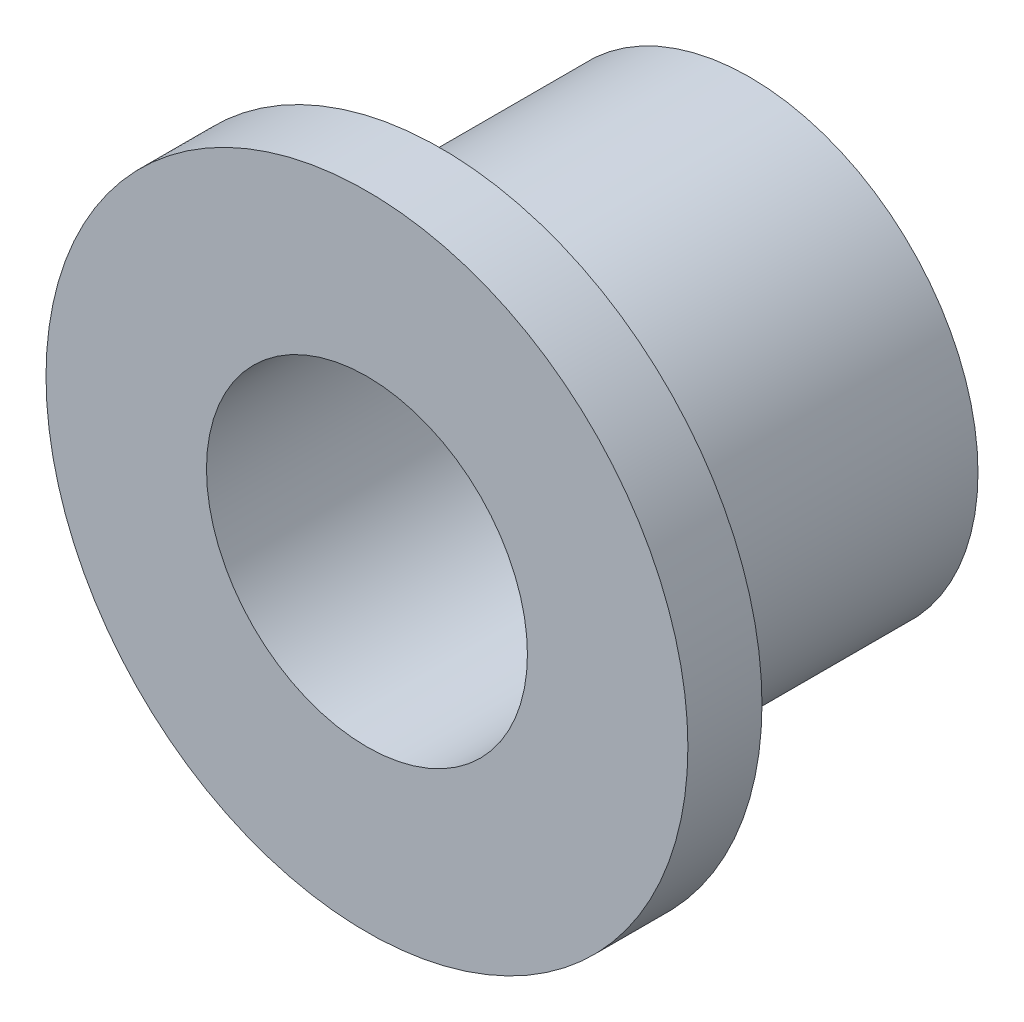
from build123d import *

# Parameters (mm, degrees)
SKETCH1_R           = 6.604
BOSS_EXTRUDE1_DEPTH = 1.524
SKETCH2_R           = 4.699
BOSS_EXTRUDE2_DEPTH = 6.35
SKETCH3_R           = 3.302
CUT_EXTRUDE1_DEPTH  = 13.215789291


with BuildPart() as part:
    # Sketch1 → Boss-Extrude1 (new body)
    with BuildSketch(Plane.XY):
        with Locations(Location((0, 0, 0), (0, 0, 180))):
            Circle(SKETCH1_R)
    extrude(amount=BOSS_EXTRUDE1_DEPTH)

    # Sketch2 → Boss-Extrude2 (add)
    with BuildSketch(Plane(origin=(0, 0, 0), x_dir=(-1, 0, 0), z_dir=(0, 0, -1))):
        Circle(SKETCH2_R)
    extrude(amount=BOSS_EXTRUDE2_DEPTH)

    # Sketch3 → Cut-Extrude1 (cut, through all)
    with BuildSketch(Plane.XY.offset(1.524)):
        Circle(SKETCH3_R)
    extrude(amount=-CUT_EXTRUDE1_DEPTH, mode=Mode.SUBTRACT)


solid = part.part
